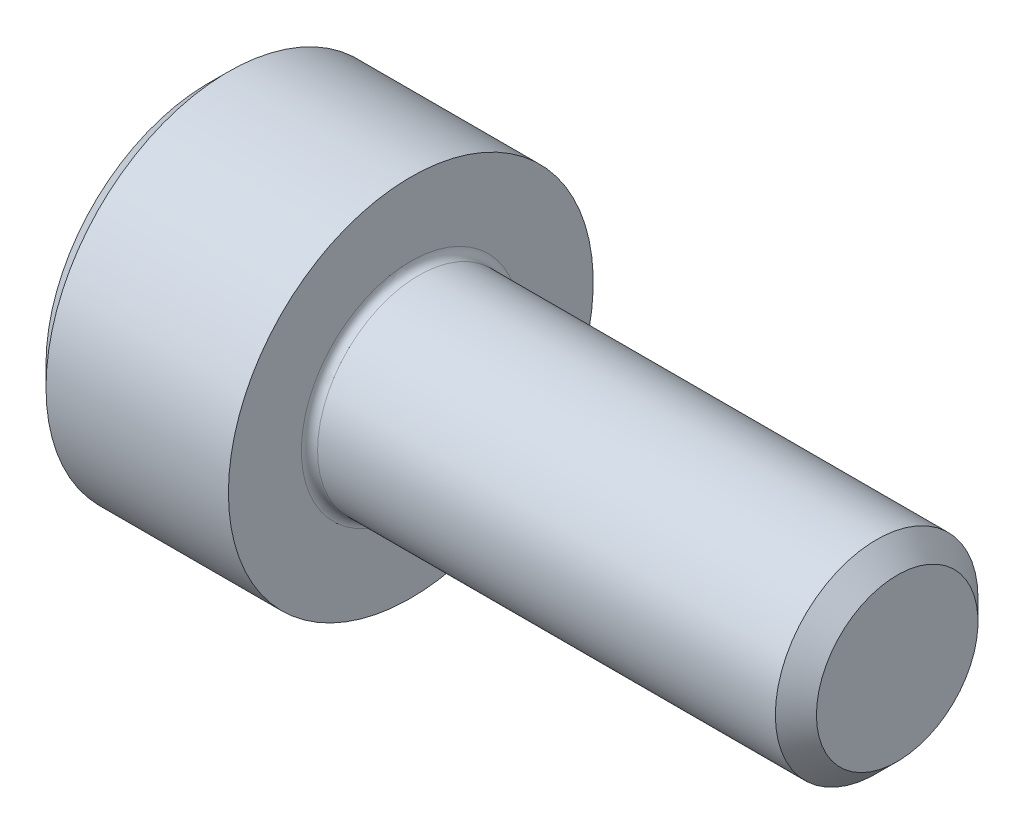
ISO-10303-21;
HEADER;
FILE_DESCRIPTION(('STEP AP214'),'2;1');
FILE_NAME('part.step','',(''),(''),'','','');
FILE_SCHEMA(('AUTOMOTIVE_DESIGN { 1 0 10303 214 1 1 1 1 }'));
ENDSEC;
DATA;
#1=APPLICATION_CONTEXT('core data for automotive mechanical design processes');
#2=APPLICATION_PROTOCOL_DEFINITION('international standard','automotive_design',2000,#1);
#3=PRODUCT_CONTEXT('',#1,'mechanical');
#4=PRODUCT('Part','Part','',(#3));
#5=PRODUCT_RELATED_PRODUCT_CATEGORY('part','',(#4));
#6=PRODUCT_DEFINITION_FORMATION('','',#4);
#7=PRODUCT_DEFINITION_CONTEXT('part definition',#1,'design');
#8=PRODUCT_DEFINITION('design','',#6,#7);
#9=PRODUCT_DEFINITION_SHAPE('','',#8);
#10=(LENGTH_UNIT() NAMED_UNIT(*) SI_UNIT(.MILLI.,.METRE.));
#11=(NAMED_UNIT(*) PLANE_ANGLE_UNIT() SI_UNIT($,.RADIAN.));
#12=(NAMED_UNIT(*) SI_UNIT($,.STERADIAN.) SOLID_ANGLE_UNIT());
#13=UNCERTAINTY_MEASURE_WITH_UNIT(LENGTH_MEASURE(1.E-05),#10,'distance_accuracy_value','');
#14=(GEOMETRIC_REPRESENTATION_CONTEXT(3) GLOBAL_UNCERTAINTY_ASSIGNED_CONTEXT((#13)) GLOBAL_UNIT_ASSIGNED_CONTEXT((#10,
#11,#12)) REPRESENTATION_CONTEXT('',''));
#15=CARTESIAN_POINT('',(0.,0.,0.));
#16=DIRECTION('',(0.,0.,1.));
#17=DIRECTION('',(1.,0.,0.));
#18=AXIS2_PLACEMENT_3D('',#15,#16,#17);
#19=CARTESIAN_POINT('',(0.,0.,0.));
#20=DIRECTION('',(-1.,0.,0.));
#21=DIRECTION('',(0.,0.,1.));
#22=AXIS2_PLACEMENT_3D('',#19,#20,#21);
#23=PLANE('',#22);
#24=DIRECTION('',(0.,-0.499999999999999,0.866025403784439));
#25=VECTOR('',#24,1.);
#26=CARTESIAN_POINT('',(0.,1.18068130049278,0.));
#27=LINE('',#26,#25);
#28=CARTESIAN_POINT('',(0.,1.18068130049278,0.));
#29=VERTEX_POINT('',#28);
#30=CARTESIAN_POINT('',(0.,0.59034065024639,1.0225));
#31=VERTEX_POINT('',#30);
#32=EDGE_CURVE('E387',#29,#31,#27,.T.);
#33=ORIENTED_EDGE('',*,*,#32,.T.);
#34=DIRECTION('',(0.,1.,0.));
#35=VECTOR('',#34,1.);
#36=CARTESIAN_POINT('',(0.,-0.590340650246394,1.0225));
#37=LINE('',#36,#35);
#38=CARTESIAN_POINT('',(0.,-0.590340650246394,1.0225));
#39=VERTEX_POINT('',#38);
#40=EDGE_CURVE('E131',#39,#31,#37,.T.);
#41=ORIENTED_EDGE('',*,*,#40,.F.);
#42=DIRECTION('',(0.,-0.500000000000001,-0.866025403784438));
#43=VECTOR('',#42,1.);
#44=CARTESIAN_POINT('',(0.,-0.590340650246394,1.0225));
#45=LINE('',#44,#43);
#46=CARTESIAN_POINT('',(0.,-1.18068130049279,0.));
#47=VERTEX_POINT('',#46);
#48=EDGE_CURVE('E390',#39,#47,#45,.T.);
#49=ORIENTED_EDGE('',*,*,#48,.T.);
#50=DIRECTION('',(0.,0.499999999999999,-0.866025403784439));
#51=VECTOR('',#50,1.);
#52=CARTESIAN_POINT('',(0.,-1.18068130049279,0.));
#53=LINE('',#52,#51);
#54=CARTESIAN_POINT('',(0.,-0.590340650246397,-1.0225));
#55=VERTEX_POINT('',#54);
#56=EDGE_CURVE('E393',#47,#55,#53,.T.);
#57=ORIENTED_EDGE('',*,*,#56,.T.);
#58=DIRECTION('',(0.,-1.,0.));
#59=VECTOR('',#58,1.);
#60=CARTESIAN_POINT('',(0.,0.590340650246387,-1.0225));
#61=LINE('',#60,#59);
#62=CARTESIAN_POINT('',(0.,0.590340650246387,-1.0225));
#63=VERTEX_POINT('',#62);
#64=EDGE_CURVE('E396',#63,#55,#61,.T.);
#65=ORIENTED_EDGE('',*,*,#64,.F.);
#66=DIRECTION('',(0.,-0.500000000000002,-0.866025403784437));
#67=VECTOR('',#66,1.);
#68=CARTESIAN_POINT('',(0.,1.18068130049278,0.));
#69=LINE('',#68,#67);
#70=EDGE_CURVE('E126',#29,#63,#69,.T.);
#71=ORIENTED_EDGE('',*,*,#70,.F.);
#72=EDGE_LOOP('',(#33,#41,#49,#57,#65,#71));
#73=FACE_BOUND('',#72,.T.);
#74=CARTESIAN_POINT('',(0.,0.,0.));
#75=DIRECTION('',(-1.,0.,0.));
#76=DIRECTION('',(0.,0.,1.));
#77=AXIS2_PLACEMENT_3D('',#74,#75,#76);
#78=CIRCLE('',#77,2.);
#79=CARTESIAN_POINT('',(0.,0.,2.));
#80=VERTEX_POINT('',#79);
#81=EDGE_CURVE('E142',#80,#80,#78,.T.);
#82=ORIENTED_EDGE('',*,*,#81,.T.);
#83=EDGE_LOOP('',(#82));
#84=FACE_BOUND('',#83,.T.);
#85=ADVANCED_FACE('F35',(#73,#84),#23,.T.);
#86=CARTESIAN_POINT('',(8.5,0.9965,0.));
#87=DIRECTION('',(1.,0.,0.));
#88=DIRECTION('',(0.,0.,-1.));
#89=AXIS2_PLACEMENT_3D('',#86,#87,#88);
#90=PLANE('',#89);
#91=CARTESIAN_POINT('',(8.5,0.,0.));
#92=DIRECTION('',(-1.,0.,0.));
#93=DIRECTION('',(0.,0.,1.));
#94=AXIS2_PLACEMENT_3D('',#91,#92,#93);
#95=CIRCLE('',#94,0.9965);
#96=CARTESIAN_POINT('',(8.5,0.,0.9965));
#97=VERTEX_POINT('',#96);
#98=EDGE_CURVE('E155',#97,#97,#95,.T.);
#99=ORIENTED_EDGE('',*,*,#98,.F.);
#100=EDGE_LOOP('',(#99));
#101=FACE_BOUND('',#100,.T.);
#102=ADVANCED_FACE('F176',(#101),#90,.T.);
#103=CARTESIAN_POINT('',(8.5,0.,0.));
#104=DIRECTION('',(-1.,0.,0.));
#105=DIRECTION('',(0.,0.,1.));
#106=AXIS2_PLACEMENT_3D('',#103,#104,#105);
#107=CONICAL_SURFACE('',#106,0.9965,0.785398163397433);
#108=CARTESIAN_POINT('',(8.2465,0.,0.));
#109=DIRECTION('',(-1.,0.,0.));
#110=DIRECTION('',(0.,0.,1.));
#111=AXIS2_PLACEMENT_3D('',#108,#109,#110);
#112=CIRCLE('',#111,1.24999999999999);
#113=CARTESIAN_POINT('',(8.2465,0.,1.24999999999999));
#114=VERTEX_POINT('',#113);
#115=EDGE_CURVE('E152',#114,#114,#112,.T.);
#116=ORIENTED_EDGE('',*,*,#115,.F.);
#117=EDGE_LOOP('',(#116));
#118=FACE_BOUND('',#117,.T.);
#119=ORIENTED_EDGE('',*,*,#98,.T.);
#120=EDGE_LOOP('',(#119));
#121=FACE_BOUND('',#120,.T.);
#122=ADVANCED_FACE('F182',(#118,#121),#107,.T.);
#123=CARTESIAN_POINT('',(-31.75,0.,0.));
#124=DIRECTION('',(-1.,0.,0.));
#125=DIRECTION('',(0.,0.,1.));
#126=AXIS2_PLACEMENT_3D('',#123,#124,#125);
#127=CYLINDRICAL_SURFACE('',#126,1.25);
#128=CARTESIAN_POINT('',(2.6,0.,0.));
#129=DIRECTION('',(1.,0.,0.));
#130=DIRECTION('',(0.,0.,-1.));
#131=AXIS2_PLACEMENT_3D('',#128,#129,#130);
#132=CIRCLE('',#131,1.25);
#133=CARTESIAN_POINT('',(2.6,0.,-1.25));
#134=VERTEX_POINT('',#133);
#135=EDGE_CURVE('E11',#134,#134,#132,.T.);
#136=ORIENTED_EDGE('',*,*,#135,.T.);
#137=EDGE_LOOP('',(#136));
#138=FACE_BOUND('',#137,.T.);
#139=ORIENTED_EDGE('',*,*,#115,.T.);
#140=EDGE_LOOP('',(#139));
#141=FACE_BOUND('',#140,.T.);
#142=ADVANCED_FACE('F193',(#138,#141),#127,.T.);
#143=CARTESIAN_POINT('',(2.5,2.25,0.));
#144=DIRECTION('',(1.,0.,0.));
#145=DIRECTION('',(0.,0.,-1.));
#146=AXIS2_PLACEMENT_3D('',#143,#144,#145);
#147=PLANE('',#146);
#148=CARTESIAN_POINT('',(2.5,0.,0.));
#149=DIRECTION('',(1.,0.,0.));
#150=DIRECTION('',(0.,0.,-1.));
#151=AXIS2_PLACEMENT_3D('',#148,#149,#150);
#152=CIRCLE('',#151,1.34999999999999);
#153=CARTESIAN_POINT('',(2.5,0.,-1.34999999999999));
#154=VERTEX_POINT('',#153);
#155=EDGE_CURVE('E43',#154,#154,#152,.F.);
#156=ORIENTED_EDGE('',*,*,#155,.T.);
#157=EDGE_LOOP('',(#156));
#158=FACE_BOUND('',#157,.T.);
#159=CARTESIAN_POINT('',(2.5,0.,0.));
#160=DIRECTION('',(-1.,0.,0.));
#161=DIRECTION('',(0.,0.,1.));
#162=AXIS2_PLACEMENT_3D('',#159,#160,#161);
#163=CIRCLE('',#162,2.25);
#164=CARTESIAN_POINT('',(2.5,0.,2.25));
#165=VERTEX_POINT('',#164);
#166=EDGE_CURVE('E149',#165,#165,#163,.T.);
#167=ORIENTED_EDGE('',*,*,#166,.F.);
#168=EDGE_LOOP('',(#167));
#169=FACE_BOUND('',#168,.T.);
#170=ADVANCED_FACE('F160',(#158,#169),#147,.T.);
#171=CARTESIAN_POINT('',(-31.75,0.,0.));
#172=DIRECTION('',(-1.,0.,0.));
#173=DIRECTION('',(0.,0.,1.));
#174=AXIS2_PLACEMENT_3D('',#171,#172,#173);
#175=CYLINDRICAL_SURFACE('',#174,2.25);
#176=ORIENTED_EDGE('',*,*,#166,.T.);
#177=EDGE_LOOP('',(#176));
#178=FACE_BOUND('',#177,.T.);
#179=CARTESIAN_POINT('',(0.25,0.,0.));
#180=DIRECTION('',(-1.,0.,0.));
#181=DIRECTION('',(0.,0.,1.));
#182=AXIS2_PLACEMENT_3D('',#179,#180,#181);
#183=CIRCLE('',#182,2.25);
#184=CARTESIAN_POINT('',(0.25,0.,2.25));
#185=VERTEX_POINT('',#184);
#186=EDGE_CURVE('E146',#185,#185,#183,.T.);
#187=ORIENTED_EDGE('',*,*,#186,.F.);
#188=EDGE_LOOP('',(#187));
#189=FACE_BOUND('',#188,.T.);
#190=ADVANCED_FACE('F171',(#178,#189),#175,.T.);
#191=CARTESIAN_POINT('',(0.,0.,0.));
#192=DIRECTION('',(1.,0.,0.));
#193=DIRECTION('',(0.,0.,-1.));
#194=AXIS2_PLACEMENT_3D('',#191,#192,#193);
#195=CONICAL_SURFACE('',#194,2.,0.785398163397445);
#196=ORIENTED_EDGE('',*,*,#186,.T.);
#197=EDGE_LOOP('',(#196));
#198=FACE_BOUND('',#197,.T.);
#199=ORIENTED_EDGE('',*,*,#81,.F.);
#200=EDGE_LOOP('',(#199));
#201=FACE_BOUND('',#200,.T.);
#202=ADVANCED_FACE('F164',(#198,#201),#195,.T.);
#203=CARTESIAN_POINT('',(2.6,0.,0.));
#204=DIRECTION('',(1.,0.,0.));
#205=DIRECTION('',(0.,0.,-1.));
#206=AXIS2_PLACEMENT_3D('',#203,#204,#205);
#207=TOROIDAL_SURFACE('',#206,1.34999999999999,0.1);
#208=ORIENTED_EDGE('',*,*,#135,.F.);
#209=EDGE_LOOP('',(#208));
#210=FACE_BOUND('',#209,.T.);
#211=ORIENTED_EDGE('',*,*,#155,.F.);
#212=EDGE_LOOP('',(#211));
#213=FACE_BOUND('',#212,.T.);
#214=ADVANCED_FACE('F37',(#210,#213),#207,.F.);
#215=CARTESIAN_POINT('',(1.1,1.18068130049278,0.));
#216=DIRECTION('',(0.,-0.866025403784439,-0.499999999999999));
#217=DIRECTION('',(0.,0.499999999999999,-0.866025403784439));
#218=AXIS2_PLACEMENT_3D('',#215,#216,#217);
#219=PLANE('',#218);
#220=ORIENTED_EDGE('',*,*,#32,.F.);
#221=DIRECTION('',(-1.,0.,0.));
#222=VECTOR('',#221,1.);
#223=CARTESIAN_POINT('',(1.1,1.18068130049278,0.));
#224=LINE('',#223,#222);
#225=CARTESIAN_POINT('',(1.1,1.18068130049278,0.));
#226=VERTEX_POINT('',#225);
#227=EDGE_CURVE('E377',#226,#29,#224,.T.);
#228=ORIENTED_EDGE('',*,*,#227,.F.);
#229=DIRECTION('',(0.,-0.499999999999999,0.866025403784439));
#230=VECTOR('',#229,1.);
#231=CARTESIAN_POINT('',(1.1,1.18068130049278,0.));
#232=LINE('',#231,#230);
#233=CARTESIAN_POINT('',(1.1,0.885510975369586,0.511249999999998));
#234=VERTEX_POINT('',#233);
#235=EDGE_CURVE('E118',#226,#234,#232,.T.);
#236=ORIENTED_EDGE('',*,*,#235,.T.);
#237=CARTESIAN_POINT('',(1.1,0.59034065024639,1.0225));
#238=VERTEX_POINT('',#237);
#239=EDGE_CURVE('E109',#234,#238,#232,.T.);
#240=ORIENTED_EDGE('',*,*,#239,.T.);
#241=DIRECTION('',(-1.,0.,0.));
#242=VECTOR('',#241,1.);
#243=CARTESIAN_POINT('',(1.1,0.59034065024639,1.0225));
#244=LINE('',#243,#242);
#245=EDGE_CURVE('E123',#238,#31,#244,.T.);
#246=ORIENTED_EDGE('',*,*,#245,.T.);
#247=EDGE_LOOP('',(#220,#228,#236,#240,#246));
#248=FACE_BOUND('',#247,.T.);
#249=ADVANCED_FACE('F122',(#248),#219,.T.);
#250=CARTESIAN_POINT('',(1.1,-0.590340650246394,1.0225));
#251=DIRECTION('',(0.,0.,1.));
#252=DIRECTION('',(0.,-1.,0.));
#253=AXIS2_PLACEMENT_3D('',#250,#251,#252);
#254=PLANE('',#253);
#255=ORIENTED_EDGE('',*,*,#40,.T.);
#256=ORIENTED_EDGE('',*,*,#245,.F.);
#257=DIRECTION('',(0.,1.,0.));
#258=VECTOR('',#257,1.);
#259=CARTESIAN_POINT('',(1.1,-0.590340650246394,1.0225));
#260=LINE('',#259,#258);
#261=CARTESIAN_POINT('',(1.1,0.,1.0225));
#262=VERTEX_POINT('',#261);
#263=EDGE_CURVE('E106',#262,#238,#260,.T.);
#264=ORIENTED_EDGE('',*,*,#263,.F.);
#265=CARTESIAN_POINT('',(1.1,-0.590340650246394,1.0225));
#266=VERTEX_POINT('',#265);
#267=EDGE_CURVE('E117',#266,#262,#260,.T.);
#268=ORIENTED_EDGE('',*,*,#267,.F.);
#269=DIRECTION('',(-1.,0.,0.));
#270=VECTOR('',#269,1.);
#271=CARTESIAN_POINT('',(1.1,-0.590340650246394,1.0225));
#272=LINE('',#271,#270);
#273=EDGE_CURVE('E133',#266,#39,#272,.T.);
#274=ORIENTED_EDGE('',*,*,#273,.T.);
#275=EDGE_LOOP('',(#255,#256,#264,#268,#274));
#276=FACE_BOUND('',#275,.T.);
#277=ADVANCED_FACE('F128',(#276),#254,.F.);
#278=CARTESIAN_POINT('',(1.1,-0.590340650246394,1.0225));
#279=DIRECTION('',(0.,0.866025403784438,-0.500000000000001));
#280=DIRECTION('',(0.,0.500000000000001,0.866025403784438));
#281=AXIS2_PLACEMENT_3D('',#278,#279,#280);
#282=PLANE('',#281);
#283=ORIENTED_EDGE('',*,*,#48,.F.);
#284=ORIENTED_EDGE('',*,*,#273,.F.);
#285=DIRECTION('',(0.,-0.500000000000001,-0.866025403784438));
#286=VECTOR('',#285,1.);
#287=CARTESIAN_POINT('',(1.1,-0.590340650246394,1.0225));
#288=LINE('',#287,#286);
#289=CARTESIAN_POINT('',(1.1,-0.885510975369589,0.511250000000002));
#290=VERTEX_POINT('',#289);
#291=EDGE_CURVE('E416',#266,#290,#288,.T.);
#292=ORIENTED_EDGE('',*,*,#291,.T.);
#293=CARTESIAN_POINT('',(1.1,-1.18068130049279,0.));
#294=VERTEX_POINT('',#293);
#295=EDGE_CURVE('E405',#290,#294,#288,.T.);
#296=ORIENTED_EDGE('',*,*,#295,.T.);
#297=DIRECTION('',(-1.,0.,0.));
#298=VECTOR('',#297,1.);
#299=CARTESIAN_POINT('',(1.1,-1.18068130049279,0.));
#300=LINE('',#299,#298);
#301=EDGE_CURVE('E138',#294,#47,#300,.T.);
#302=ORIENTED_EDGE('',*,*,#301,.T.);
#303=EDGE_LOOP('',(#283,#284,#292,#296,#302));
#304=FACE_BOUND('',#303,.T.);
#305=ADVANCED_FACE('F268',(#304),#282,.T.);
#306=CARTESIAN_POINT('',(1.1,-1.18068130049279,0.));
#307=DIRECTION('',(0.,0.866025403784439,0.499999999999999));
#308=DIRECTION('',(0.,-0.499999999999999,0.866025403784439));
#309=AXIS2_PLACEMENT_3D('',#306,#307,#308);
#310=PLANE('',#309);
#311=ORIENTED_EDGE('',*,*,#56,.F.);
#312=ORIENTED_EDGE('',*,*,#301,.F.);
#313=DIRECTION('',(0.,0.499999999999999,-0.866025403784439));
#314=VECTOR('',#313,1.);
#315=CARTESIAN_POINT('',(1.1,-1.18068130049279,0.));
#316=LINE('',#315,#314);
#317=CARTESIAN_POINT('',(1.1,-0.885510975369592,-0.511250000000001));
#318=VERTEX_POINT('',#317);
#319=EDGE_CURVE('E383',#294,#318,#316,.T.);
#320=ORIENTED_EDGE('',*,*,#319,.T.);
#321=CARTESIAN_POINT('',(1.1,-0.590340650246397,-1.0225));
#322=VERTEX_POINT('',#321);
#323=EDGE_CURVE('E415',#318,#322,#316,.T.);
#324=ORIENTED_EDGE('',*,*,#323,.T.);
#325=DIRECTION('',(-1.,0.,0.));
#326=VECTOR('',#325,1.);
#327=CARTESIAN_POINT('',(1.1,-0.590340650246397,-1.0225));
#328=LINE('',#327,#326);
#329=EDGE_CURVE('E376',#322,#55,#328,.T.);
#330=ORIENTED_EDGE('',*,*,#329,.T.);
#331=EDGE_LOOP('',(#311,#312,#320,#324,#330));
#332=FACE_BOUND('',#331,.T.);
#333=ADVANCED_FACE('F276',(#332),#310,.T.);
#334=CARTESIAN_POINT('',(1.1,0.590340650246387,-1.0225));
#335=DIRECTION('',(0.,0.,-1.));
#336=DIRECTION('',(0.,1.,0.));
#337=AXIS2_PLACEMENT_3D('',#334,#335,#336);
#338=PLANE('',#337);
#339=ORIENTED_EDGE('',*,*,#64,.T.);
#340=ORIENTED_EDGE('',*,*,#329,.F.);
#341=DIRECTION('',(0.,-1.,0.));
#342=VECTOR('',#341,1.);
#343=CARTESIAN_POINT('',(1.1,0.590340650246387,-1.0225));
#344=LINE('',#343,#342);
#345=CARTESIAN_POINT('',(1.1,0.,-1.0225));
#346=VERTEX_POINT('',#345);
#347=EDGE_CURVE('E380',#346,#322,#344,.T.);
#348=ORIENTED_EDGE('',*,*,#347,.F.);
#349=CARTESIAN_POINT('',(1.1,0.590340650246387,-1.0225));
#350=VERTEX_POINT('',#349);
#351=EDGE_CURVE('E50',#350,#346,#344,.T.);
#352=ORIENTED_EDGE('',*,*,#351,.F.);
#353=DIRECTION('',(-1.,0.,0.));
#354=VECTOR('',#353,1.);
#355=CARTESIAN_POINT('',(1.1,0.590340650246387,-1.0225));
#356=LINE('',#355,#354);
#357=EDGE_CURVE('E373',#350,#63,#356,.T.);
#358=ORIENTED_EDGE('',*,*,#357,.T.);
#359=EDGE_LOOP('',(#339,#340,#348,#352,#358));
#360=FACE_BOUND('',#359,.T.);
#361=ADVANCED_FACE('F285',(#360),#338,.F.);
#362=CARTESIAN_POINT('',(1.1,1.18068130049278,0.));
#363=DIRECTION('',(0.,0.866025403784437,-0.500000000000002));
#364=DIRECTION('',(0.,0.500000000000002,0.866025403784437));
#365=AXIS2_PLACEMENT_3D('',#362,#363,#364);
#366=PLANE('',#365);
#367=ORIENTED_EDGE('',*,*,#70,.T.);
#368=ORIENTED_EDGE('',*,*,#357,.F.);
#369=DIRECTION('',(0.,-0.500000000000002,-0.866025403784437));
#370=VECTOR('',#369,1.);
#371=CARTESIAN_POINT('',(1.1,1.18068130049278,0.));
#372=LINE('',#371,#370);
#373=CARTESIAN_POINT('',(1.1,0.885510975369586,-0.511250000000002));
#374=VERTEX_POINT('',#373);
#375=EDGE_CURVE('E363',#374,#350,#372,.T.);
#376=ORIENTED_EDGE('',*,*,#375,.F.);
#377=EDGE_CURVE('E369',#226,#374,#372,.T.);
#378=ORIENTED_EDGE('',*,*,#377,.F.);
#379=ORIENTED_EDGE('',*,*,#227,.T.);
#380=EDGE_LOOP('',(#367,#368,#376,#378,#379));
#381=FACE_BOUND('',#380,.T.);
#382=ADVANCED_FACE('F294',(#381),#366,.F.);
#383=CARTESIAN_POINT('',(1.1,1.18068130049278,0.));
#384=DIRECTION('',(1.,0.,0.));
#385=DIRECTION('',(0.,0.,-1.));
#386=AXIS2_PLACEMENT_3D('',#383,#384,#385);
#387=PLANE('',#386);
#388=ORIENTED_EDGE('',*,*,#347,.T.);
#389=ORIENTED_EDGE('',*,*,#323,.F.);
#390=CARTESIAN_POINT('',(1.1,0.,0.));
#391=DIRECTION('',(-1.,0.,0.));
#392=DIRECTION('',(0.,0.,1.));
#393=AXIS2_PLACEMENT_3D('',#390,#391,#392);
#394=CIRCLE('',#393,1.0225);
#395=EDGE_CURVE('E411',#346,#318,#394,.T.);
#396=ORIENTED_EDGE('',*,*,#395,.F.);
#397=EDGE_LOOP('',(#388,#389,#396));
#398=FACE_BOUND('',#397,.T.);
#399=ADVANCED_FACE('F303',(#398),#387,.F.);
#400=ORIENTED_EDGE('',*,*,#319,.F.);
#401=ORIENTED_EDGE('',*,*,#295,.F.);
#402=EDGE_CURVE('E136',#318,#290,#394,.T.);
#403=ORIENTED_EDGE('',*,*,#402,.F.);
#404=EDGE_LOOP('',(#400,#401,#403));
#405=FACE_BOUND('',#404,.T.);
#406=ADVANCED_FACE('F312',(#405),#387,.F.);
#407=ORIENTED_EDGE('',*,*,#291,.F.);
#408=ORIENTED_EDGE('',*,*,#267,.T.);
#409=EDGE_CURVE('E132',#290,#262,#394,.T.);
#410=ORIENTED_EDGE('',*,*,#409,.F.);
#411=EDGE_LOOP('',(#407,#408,#410));
#412=FACE_BOUND('',#411,.T.);
#413=ADVANCED_FACE('F321',(#412),#387,.F.);
#414=ORIENTED_EDGE('',*,*,#263,.T.);
#415=ORIENTED_EDGE('',*,*,#239,.F.);
#416=EDGE_CURVE('E112',#262,#234,#394,.T.);
#417=ORIENTED_EDGE('',*,*,#416,.F.);
#418=EDGE_LOOP('',(#414,#415,#417));
#419=FACE_BOUND('',#418,.T.);
#420=ADVANCED_FACE('F108',(#419),#387,.F.);
#421=ORIENTED_EDGE('',*,*,#235,.F.);
#422=ORIENTED_EDGE('',*,*,#377,.T.);
#423=EDGE_CURVE('E143',#234,#374,#394,.T.);
#424=ORIENTED_EDGE('',*,*,#423,.F.);
#425=EDGE_LOOP('',(#421,#422,#424));
#426=FACE_BOUND('',#425,.T.);
#427=ADVANCED_FACE('F336',(#426),#387,.F.);
#428=ORIENTED_EDGE('',*,*,#375,.T.);
#429=ORIENTED_EDGE('',*,*,#351,.T.);
#430=EDGE_CURVE('E366',#374,#346,#394,.T.);
#431=ORIENTED_EDGE('',*,*,#430,.F.);
#432=EDGE_LOOP('',(#428,#429,#431));
#433=FACE_BOUND('',#432,.T.);
#434=ADVANCED_FACE('F251',(#433),#387,.F.);
#435=CARTESIAN_POINT('',(1.1,0.,0.));
#436=DIRECTION('',(-1.,0.,0.));
#437=DIRECTION('',(0.,0.,1.));
#438=AXIS2_PLACEMENT_3D('',#435,#436,#437);
#439=CONICAL_SURFACE('',#438,1.0225,1.04719755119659);
#440=CARTESIAN_POINT('',(1.6903406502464,0.,0.));
#441=VERTEX_POINT('',#440);
#442=VERTEX_LOOP('',#441);
#443=FACE_BOUND('',#442,.T.);
#444=ORIENTED_EDGE('',*,*,#416,.T.);
#445=ORIENTED_EDGE('',*,*,#423,.T.);
#446=ORIENTED_EDGE('',*,*,#430,.T.);
#447=ORIENTED_EDGE('',*,*,#395,.T.);
#448=ORIENTED_EDGE('',*,*,#402,.T.);
#449=ORIENTED_EDGE('',*,*,#409,.T.);
#450=EDGE_LOOP('',(#444,#445,#446,#447,#448,#449));
#451=FACE_BOUND('',#450,.T.);
#452=ADVANCED_FACE('F186',(#443,#451),#439,.F.);
#453=CLOSED_SHELL('',(#85,#102,#122,#142,#170,#190,#202,#214,#249,#277,#305,#333,#361,#382,#399,
#406,#413,#420,#427,#434,#452));
#454=MANIFOLD_SOLID_BREP('B2',#453);
#455=ADVANCED_BREP_SHAPE_REPRESENTATION('',(#18,#454),#14);
#456=SHAPE_DEFINITION_REPRESENTATION(#9,#455);
ENDSEC;
END-ISO-10303-21;
